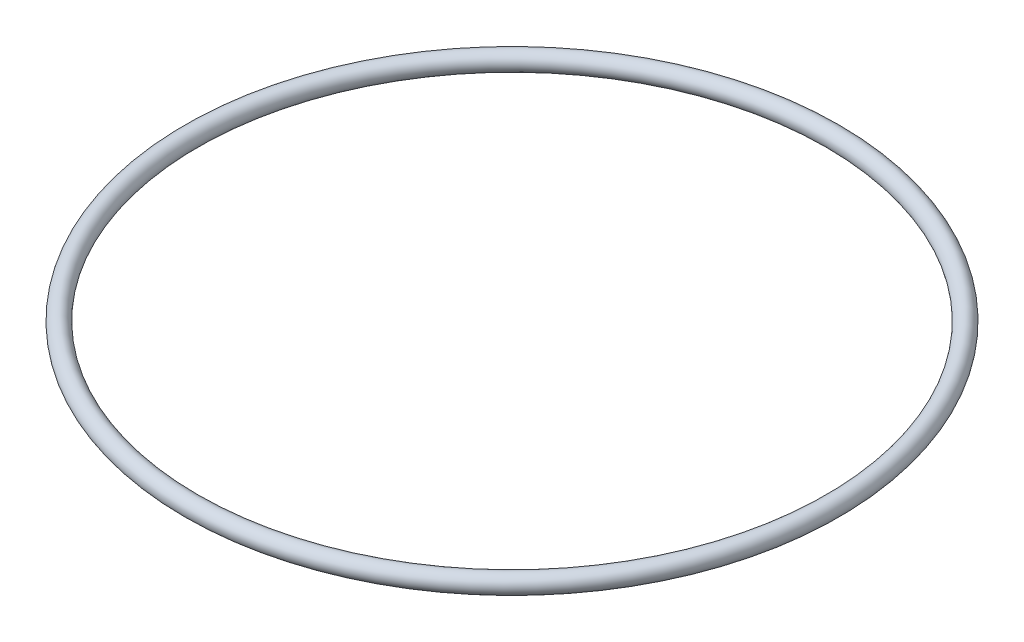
ISO-10303-21;
HEADER;
FILE_DESCRIPTION(('STEP AP214'),'2;1');
FILE_NAME('part.step','',(''),(''),'','','');
FILE_SCHEMA(('AUTOMOTIVE_DESIGN { 1 0 10303 214 1 1 1 1 }'));
ENDSEC;
DATA;
#1=APPLICATION_CONTEXT('core data for automotive mechanical design processes');
#2=APPLICATION_PROTOCOL_DEFINITION('international standard','automotive_design',2000,#1);
#3=PRODUCT_CONTEXT('',#1,'mechanical');
#4=PRODUCT('Part','Part','',(#3));
#5=PRODUCT_RELATED_PRODUCT_CATEGORY('part','',(#4));
#6=PRODUCT_DEFINITION_FORMATION('','',#4);
#7=PRODUCT_DEFINITION_CONTEXT('part definition',#1,'design');
#8=PRODUCT_DEFINITION('design','',#6,#7);
#9=PRODUCT_DEFINITION_SHAPE('','',#8);
#10=(LENGTH_UNIT() NAMED_UNIT(*) SI_UNIT(.MILLI.,.METRE.));
#11=(NAMED_UNIT(*) PLANE_ANGLE_UNIT() SI_UNIT($,.RADIAN.));
#12=(NAMED_UNIT(*) SI_UNIT($,.STERADIAN.) SOLID_ANGLE_UNIT());
#13=UNCERTAINTY_MEASURE_WITH_UNIT(LENGTH_MEASURE(1.E-05),#10,'distance_accuracy_value','');
#14=(GEOMETRIC_REPRESENTATION_CONTEXT(3) GLOBAL_UNCERTAINTY_ASSIGNED_CONTEXT((#13)) GLOBAL_UNIT_ASSIGNED_CONTEXT((#10,
#11,#12)) REPRESENTATION_CONTEXT('',''));
#15=CARTESIAN_POINT('',(0.,0.,0.));
#16=DIRECTION('',(0.,0.,1.));
#17=DIRECTION('',(1.,0.,0.));
#18=AXIS2_PLACEMENT_3D('',#15,#16,#17);
#19=CARTESIAN_POINT('',(0.,3.,0.));
#20=DIRECTION('',(0.,1.,0.));
#21=DIRECTION('',(0.,0.,1.));
#22=AXIS2_PLACEMENT_3D('',#19,#20,#21);
#23=TOROIDAL_SURFACE('',#22,105.5,3.00000000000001);
#24=CARTESIAN_POINT('',(0.,3.,108.5));
#25=VERTEX_POINT('',#24);
#26=VERTEX_LOOP('',#25);
#27=FACE_BOUND('',#26,.T.);
#28=ADVANCED_FACE('F30',(#27),#23,.T.);
#29=CLOSED_SHELL('',(#28));
#30=MANIFOLD_SOLID_BREP('B2',#29);
#31=ADVANCED_BREP_SHAPE_REPRESENTATION('',(#18,#30),#14);
#32=SHAPE_DEFINITION_REPRESENTATION(#9,#31);
ENDSEC;
END-ISO-10303-21;
